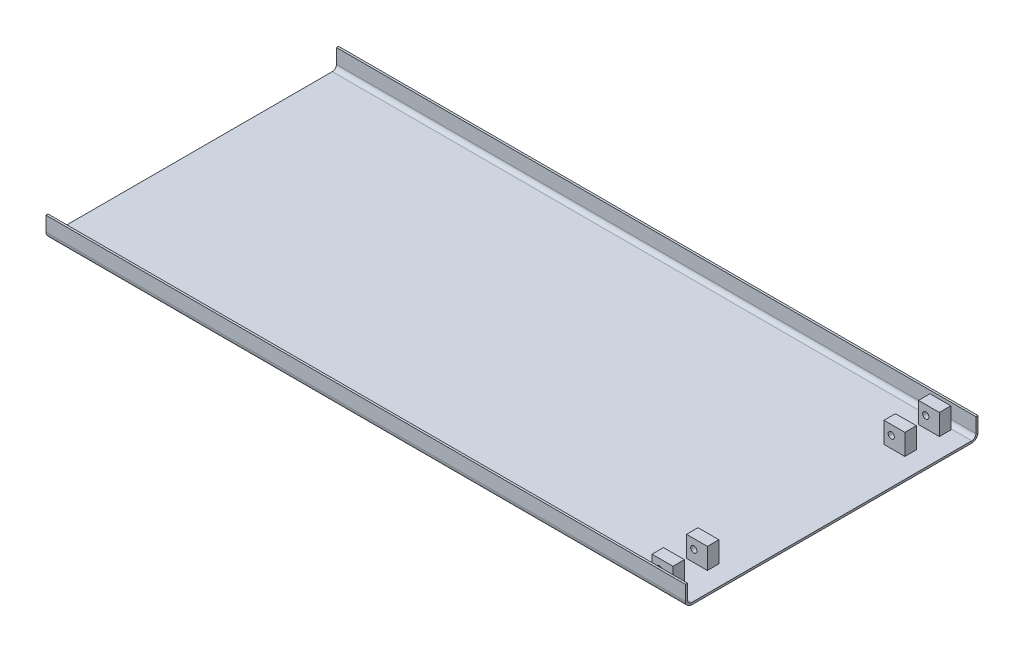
from build123d import *

# Parameters (mm, degrees)
EXTRUDE_THIN1_DEPTH = 1530
SKETCH2_W           = 100
SKETCH2_H           = 55
BOSS_EXTRUDE1_DEPTH = 100
CUT_EXTRUDE1_REACH  = 2055.345
SKETCH3_R           = 15


with BuildPart() as part:
    # Sketch1 → Extrude-Thin1 (new, symmetric)
    with BuildSketch(Plane(origin=(0, 0, 0), x_dir=(0, 0, -1), z_dir=(1, 0, 0))):
        with BuildLine():
            Line((-700, 100), (-700, 30))
            ThreePointArc((-700, 30), (-691.213203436, 8.786796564), (-670, 0))
            Line((-670, 0), (670, 0))
            ThreePointArc((670, 0), (691.213203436, 8.786796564), (700, 30))
            Line((700, 30), (700, 100))
            Line((700, 100), (690, 100))
            Line((690, 100), (690, 30))
            ThreePointArc((690, 30), (684.142135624, 15.857864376), (670, 10))
            Line((670, 10), (-670, 10))
            ThreePointArc((-670, 10), (-684.142135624, 15.857864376), (-690, 30))
            Line((-690, 30), (-690, 100))
            Line((-690, 100), (-700, 100))
        make_face()
    extrude(amount=EXTRUDE_THIN1_DEPTH, both=True)

    # Sketch2 → Boss-Extrude1 (add)
    with BuildSketch(Plane(origin=(0, 10, 0), x_dir=(1, 0, 0), z_dir=(0, 1, 0))):
        with Locations((1385, -637.5)):
            Rectangle(SKETCH2_W, SKETCH2_H)
        with Locations((1385, -472.5)):
            Rectangle(SKETCH2_W, SKETCH2_H)
        with Locations((1385, 472.5)):
            Rectangle(SKETCH2_W, SKETCH2_H)
        with Locations((1385, 637.5)):
            Rectangle(SKETCH2_W, SKETCH2_H)
    extrude(amount=BOSS_EXTRUDE1_DEPTH)

    # Cut-Extrude1: up to this face of the body (flat: up to its plane)
    cut_extrude1_end = Plane(part.part.faces().sort_by_distance((1385, 60, -665))[0])
    # Sketch3 → Cut-Extrude1 (cut, up to the picked face)
    with BuildSketch(Plane.XY.offset(665), mode=Mode.PRIVATE) as cut_extrude1_sk1:
        with Locations((1370, 65)):
            Circle(SKETCH3_R)
    cut_extrude1_tool1 = split(extrude(cut_extrude1_sk1.sketch, amount=-CUT_EXTRUDE1_REACH, mode=Mode.PRIVATE), bisect_by=cut_extrude1_end, keep=Keep.BOTH, mode=Mode.PRIVATE)
    add(cut_extrude1_tool1.solids().sort_by(Axis((1370, 65, 665), (0, 0, -1)))[0], mode=Mode.SUBTRACT)


solid = part.part
